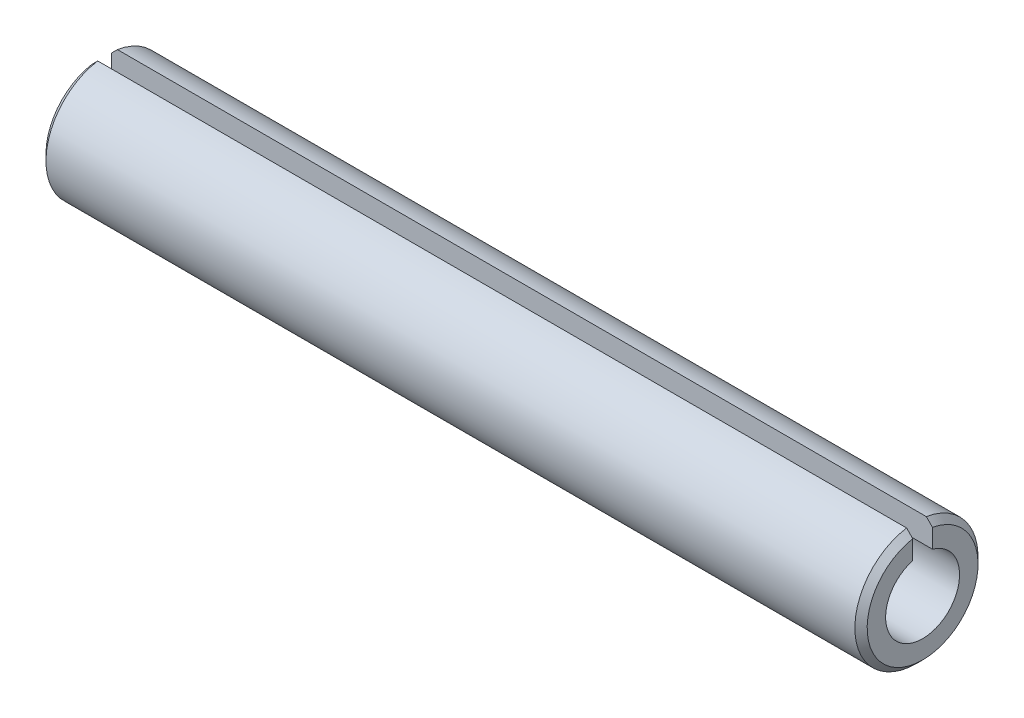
ISO-10303-21;
HEADER;
FILE_DESCRIPTION(('STEP AP214'),'2;1');
FILE_NAME('part.step','',(''),(''),'','','');
FILE_SCHEMA(('AUTOMOTIVE_DESIGN { 1 0 10303 214 1 1 1 1 }'));
ENDSEC;
DATA;
#1=APPLICATION_CONTEXT('core data for automotive mechanical design processes');
#2=APPLICATION_PROTOCOL_DEFINITION('international standard','automotive_design',2000,#1);
#3=PRODUCT_CONTEXT('',#1,'mechanical');
#4=PRODUCT('Part','Part','',(#3));
#5=PRODUCT_RELATED_PRODUCT_CATEGORY('part','',(#4));
#6=PRODUCT_DEFINITION_FORMATION('','',#4);
#7=PRODUCT_DEFINITION_CONTEXT('part definition',#1,'design');
#8=PRODUCT_DEFINITION('design','',#6,#7);
#9=PRODUCT_DEFINITION_SHAPE('','',#8);
#10=(LENGTH_UNIT() NAMED_UNIT(*) SI_UNIT(.MILLI.,.METRE.));
#11=(NAMED_UNIT(*) PLANE_ANGLE_UNIT() SI_UNIT($,.RADIAN.));
#12=(NAMED_UNIT(*) SI_UNIT($,.STERADIAN.) SOLID_ANGLE_UNIT());
#13=UNCERTAINTY_MEASURE_WITH_UNIT(LENGTH_MEASURE(1.E-05),#10,'distance_accuracy_value','');
#14=(GEOMETRIC_REPRESENTATION_CONTEXT(3) GLOBAL_UNCERTAINTY_ASSIGNED_CONTEXT((#13)) GLOBAL_UNIT_ASSIGNED_CONTEXT((#10,
#11,#12)) REPRESENTATION_CONTEXT('',''));
#15=CARTESIAN_POINT('',(0.,0.,0.));
#16=DIRECTION('',(0.,0.,1.));
#17=DIRECTION('',(1.,0.,0.));
#18=AXIS2_PLACEMENT_3D('',#15,#16,#17);
#19=CARTESIAN_POINT('',(0.,0.,0.));
#20=DIRECTION('',(-1.,0.,0.));
#21=DIRECTION('',(0.,0.,1.));
#22=AXIS2_PLACEMENT_3D('',#19,#20,#21);
#23=CYLINDRICAL_SURFACE('',#22,1.8);
#24=DIRECTION('',(-1.,0.,0.));
#25=VECTOR('',#24,1.);
#26=CARTESIAN_POINT('',(40.,1.73481987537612,0.48));
#27=LINE('',#26,#25);
#28=CARTESIAN_POINT('',(40.,1.73481987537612,0.48));
#29=VERTEX_POINT('',#28);
#30=CARTESIAN_POINT('',(0.,1.73481987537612,0.48));
#31=VERTEX_POINT('',#30);
#32=EDGE_CURVE('E47',#29,#31,#27,.T.);
#33=ORIENTED_EDGE('',*,*,#32,.F.);
#34=CARTESIAN_POINT('',(40.,0.,0.));
#35=DIRECTION('',(-1.,0.,0.));
#36=DIRECTION('',(0.,0.,1.));
#37=AXIS2_PLACEMENT_3D('',#34,#35,#36);
#38=CIRCLE('',#37,1.8);
#39=CARTESIAN_POINT('',(40.,1.73481987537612,-0.48));
#40=VERTEX_POINT('',#39);
#41=EDGE_CURVE('E89',#40,#29,#38,.T.);
#42=ORIENTED_EDGE('',*,*,#41,.F.);
#43=DIRECTION('',(-1.,0.,0.));
#44=VECTOR('',#43,1.);
#45=CARTESIAN_POINT('',(40.,1.73481987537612,-0.48));
#46=LINE('',#45,#44);
#47=CARTESIAN_POINT('',(0.,1.73481987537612,-0.48));
#48=VERTEX_POINT('',#47);
#49=EDGE_CURVE('E83',#40,#48,#46,.T.);
#50=ORIENTED_EDGE('',*,*,#49,.T.);
#51=CARTESIAN_POINT('',(0.,0.,0.));
#52=DIRECTION('',(-1.,0.,0.));
#53=DIRECTION('',(0.,0.,1.));
#54=AXIS2_PLACEMENT_3D('',#51,#52,#53);
#55=CIRCLE('',#54,1.8);
#56=EDGE_CURVE('E93',#48,#31,#55,.T.);
#57=ORIENTED_EDGE('',*,*,#56,.T.);
#58=EDGE_LOOP('',(#33,#42,#50,#57));
#59=FACE_BOUND('',#58,.T.);
#60=ADVANCED_FACE('F33',(#59),#23,.F.);
#61=CARTESIAN_POINT('',(40.,1.8,0.));
#62=DIRECTION('',(-1.,0.,0.));
#63=DIRECTION('',(0.,0.,1.));
#64=AXIS2_PLACEMENT_3D('',#61,#62,#63);
#65=PLANE('',#64);
#66=DIRECTION('',(0.,-1.,0.));
#67=VECTOR('',#66,1.);
#68=CARTESIAN_POINT('',(40.,2.96135104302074,0.48));
#69=LINE('',#68,#67);
#70=CARTESIAN_POINT('',(40.,2.65699077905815,0.48));
#71=VERTEX_POINT('',#70);
#72=EDGE_CURVE('E129',#71,#29,#69,.T.);
#73=ORIENTED_EDGE('',*,*,#72,.F.);
#74=CARTESIAN_POINT('',(40.,0.,0.));
#75=DIRECTION('',(-1.,0.,0.));
#76=DIRECTION('',(0.,0.,1.));
#77=AXIS2_PLACEMENT_3D('',#74,#75,#76);
#78=CIRCLE('',#77,2.70000000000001);
#79=CARTESIAN_POINT('',(40.,2.65699077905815,-0.48));
#80=VERTEX_POINT('',#79);
#81=EDGE_CURVE('E121',#80,#71,#78,.T.);
#82=ORIENTED_EDGE('',*,*,#81,.F.);
#83=DIRECTION('',(0.,-1.,0.));
#84=VECTOR('',#83,1.);
#85=CARTESIAN_POINT('',(40.,2.96135104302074,-0.48));
#86=LINE('',#85,#84);
#87=EDGE_CURVE('E130',#80,#40,#86,.T.);
#88=ORIENTED_EDGE('',*,*,#87,.T.);
#89=ORIENTED_EDGE('',*,*,#41,.T.);
#90=EDGE_LOOP('',(#73,#82,#88,#89));
#91=FACE_BOUND('',#90,.T.);
#92=ADVANCED_FACE('F127',(#91),#65,.F.);
#93=CARTESIAN_POINT('',(40.,0.,0.));
#94=DIRECTION('',(-1.,0.,0.));
#95=DIRECTION('',(0.,0.,1.));
#96=AXIS2_PLACEMENT_3D('',#93,#94,#95);
#97=CONICAL_SURFACE('',#96,2.70000000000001,0.785398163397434);
#98=CARTESIAN_POINT('',(38.172376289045,4.5021080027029,0.48));
#99=CARTESIAN_POINT('',(38.3124694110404,4.36121634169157,0.48));
#100=CARTESIAN_POINT('',(38.4525296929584,4.22029197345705,0.48));
#101=CARTESIAN_POINT('',(38.7325483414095,3.93834411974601,0.48));
#102=CARTESIAN_POINT('',(38.8725067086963,3.797320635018,0.48));
#103=CARTESIAN_POINT('',(39.1522810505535,3.51514513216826,0.48));
#104=CARTESIAN_POINT('',(39.2920970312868,3.37399312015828,0.48));
#105=CARTESIAN_POINT('',(39.5715338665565,3.09149379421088,0.48));
#106=CARTESIAN_POINT('',(39.7111547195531,2.95014647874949,0.48));
#107=CARTESIAN_POINT('',(39.9901090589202,2.66714775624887,0.48));
#108=CARTESIAN_POINT('',(40.1294425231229,2.52549632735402,0.48));
#109=CARTESIAN_POINT('',(40.4076320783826,2.24172964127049,0.48));
#110=CARTESIAN_POINT('',(40.5464881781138,2.09961439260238,0.48));
#111=CARTESIAN_POINT('',(40.7541331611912,1.88580999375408,0.48));
#112=CARTESIAN_POINT('',(40.823244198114,1.81443392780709,0.48));
#113=CARTESIAN_POINT('',(40.9611585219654,1.67138644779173,0.48));
#114=CARTESIAN_POINT('',(41.0299618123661,1.59971503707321,0.48));
#115=CARTESIAN_POINT('',(41.1671274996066,1.45594150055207,0.48));
#116=CARTESIAN_POINT('',(41.2354898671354,1.38383934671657,0.48));
#117=CARTESIAN_POINT('',(41.3375138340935,1.27519517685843,0.48));
#118=CARTESIAN_POINT('',(41.3714358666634,1.23889793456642,0.48));
#119=CARTESIAN_POINT('',(41.4390521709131,1.16609108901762,0.48));
#120=CARTESIAN_POINT('',(41.4727464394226,1.12958148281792,0.48));
#121=CARTESIAN_POINT('',(41.5062992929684,1.09294161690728,0.48));
#122=B_SPLINE_CURVE_WITH_KNOTS('',3,(#98,#99,#100,#101,#102,#103,#104,#105,#106,#107,#108,#109,
#110,#111,#112,#113,#114,#115,#116,#117,#118,#119,#120,#121),.UNSPECIFIED.,.F.,.F.,(4,2,2,2,2,2,
2,2,2,2,2,4),(0.,0.596061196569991,1.19211793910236,1.78814768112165,2.38418210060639,
2.98026089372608,3.57632879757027,3.87438502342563,4.17243787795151,4.470510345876,
4.61955225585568,4.76859623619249),.UNSPECIFIED.);
#123=CARTESIAN_POINT('',(39.7,2.96135104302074,0.48));
#124=VERTEX_POINT('',#123);
#125=EDGE_CURVE('E101',#124,#71,#122,.T.);
#126=ORIENTED_EDGE('',*,*,#125,.F.);
#127=CARTESIAN_POINT('',(39.7,0.,0.));
#128=DIRECTION('',(-1.,0.,0.));
#129=DIRECTION('',(0.,0.,1.));
#130=AXIS2_PLACEMENT_3D('',#127,#128,#129);
#131=CIRCLE('',#130,3.);
#132=CARTESIAN_POINT('',(39.7,2.96135104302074,-0.48));
#133=VERTEX_POINT('',#132);
#134=EDGE_CURVE('E118',#133,#124,#131,.T.);
#135=ORIENTED_EDGE('',*,*,#134,.F.);
#136=CARTESIAN_POINT('',(38.172376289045,4.5021080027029,-0.48));
#137=CARTESIAN_POINT('',(38.3124694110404,4.36121634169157,-0.48));
#138=CARTESIAN_POINT('',(38.4525296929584,4.22029197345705,-0.48));
#139=CARTESIAN_POINT('',(38.7325483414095,3.93834411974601,-0.48));
#140=CARTESIAN_POINT('',(38.8725067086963,3.797320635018,-0.48));
#141=CARTESIAN_POINT('',(39.1522810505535,3.51514513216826,-0.48));
#142=CARTESIAN_POINT('',(39.2920970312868,3.37399312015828,-0.48));
#143=CARTESIAN_POINT('',(39.5715338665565,3.09149379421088,-0.48));
#144=CARTESIAN_POINT('',(39.7111547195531,2.95014647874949,-0.48));
#145=CARTESIAN_POINT('',(39.9901090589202,2.66714775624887,-0.48));
#146=CARTESIAN_POINT('',(40.1294425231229,2.52549632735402,-0.48));
#147=CARTESIAN_POINT('',(40.4076320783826,2.24172964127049,-0.48));
#148=CARTESIAN_POINT('',(40.5464881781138,2.09961439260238,-0.48));
#149=CARTESIAN_POINT('',(40.7541331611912,1.88580999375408,-0.48));
#150=CARTESIAN_POINT('',(40.823244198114,1.81443392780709,-0.48));
#151=CARTESIAN_POINT('',(40.9611585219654,1.67138644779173,-0.48));
#152=CARTESIAN_POINT('',(41.0299618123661,1.59971503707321,-0.48));
#153=CARTESIAN_POINT('',(41.1671274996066,1.45594150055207,-0.48));
#154=CARTESIAN_POINT('',(41.2354898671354,1.38383934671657,-0.48));
#155=CARTESIAN_POINT('',(41.3375138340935,1.27519517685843,-0.48));
#156=CARTESIAN_POINT('',(41.3714358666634,1.23889793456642,-0.48));
#157=CARTESIAN_POINT('',(41.4390521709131,1.16609108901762,-0.48));
#158=CARTESIAN_POINT('',(41.4727464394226,1.12958148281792,-0.48));
#159=CARTESIAN_POINT('',(41.5062992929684,1.09294161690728,-0.48));
#160=B_SPLINE_CURVE_WITH_KNOTS('',3,(#136,#137,#138,#139,#140,#141,#142,#143,#144,#145,#146,
#147,#148,#149,#150,#151,#152,#153,#154,#155,#156,#157,#158,#159),.UNSPECIFIED.,.F.,.F.,(4,2,2,
2,2,2,2,2,2,2,2,4),(0.,0.596061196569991,1.19211793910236,1.78814768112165,2.38418210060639,
2.98026089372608,3.57632879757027,3.87438502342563,4.17243787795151,4.470510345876,
4.61955225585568,4.76859623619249),.UNSPECIFIED.);
#161=EDGE_CURVE('E146',#133,#80,#160,.T.);
#162=ORIENTED_EDGE('',*,*,#161,.T.);
#163=ORIENTED_EDGE('',*,*,#81,.T.);
#164=EDGE_LOOP('',(#126,#135,#162,#163));
#165=FACE_BOUND('',#164,.T.);
#166=ADVANCED_FACE('F168',(#165),#97,.T.);
#167=CARTESIAN_POINT('',(0.,0.,0.));
#168=DIRECTION('',(-1.,0.,0.));
#169=DIRECTION('',(0.,0.,1.));
#170=AXIS2_PLACEMENT_3D('',#167,#168,#169);
#171=CYLINDRICAL_SURFACE('',#170,3.);
#172=DIRECTION('',(-1.,0.,0.));
#173=VECTOR('',#172,1.);
#174=CARTESIAN_POINT('',(40.,2.96135104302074,0.48));
#175=LINE('',#174,#173);
#176=CARTESIAN_POINT('',(0.3,2.96135104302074,0.48));
#177=VERTEX_POINT('',#176);
#178=EDGE_CURVE('E137',#124,#177,#175,.T.);
#179=ORIENTED_EDGE('',*,*,#178,.T.);
#180=CARTESIAN_POINT('',(0.299999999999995,0.,0.));
#181=DIRECTION('',(-1.,0.,0.));
#182=DIRECTION('',(0.,0.,1.));
#183=AXIS2_PLACEMENT_3D('',#180,#181,#182);
#184=CIRCLE('',#183,3.);
#185=CARTESIAN_POINT('',(0.3,2.96135104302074,-0.48));
#186=VERTEX_POINT('',#185);
#187=EDGE_CURVE('E105',#186,#177,#184,.T.);
#188=ORIENTED_EDGE('',*,*,#187,.F.);
#189=DIRECTION('',(-1.,0.,0.));
#190=VECTOR('',#189,1.);
#191=CARTESIAN_POINT('',(40.,2.96135104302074,-0.48));
#192=LINE('',#191,#190);
#193=EDGE_CURVE('E96',#133,#186,#192,.T.);
#194=ORIENTED_EDGE('',*,*,#193,.F.);
#195=ORIENTED_EDGE('',*,*,#134,.T.);
#196=EDGE_LOOP('',(#179,#188,#194,#195));
#197=FACE_BOUND('',#196,.T.);
#198=ADVANCED_FACE('F172',(#197),#171,.T.);
#199=CARTESIAN_POINT('',(0.299999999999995,0.,0.));
#200=DIRECTION('',(1.,0.,0.));
#201=DIRECTION('',(0.,0.,-1.));
#202=AXIS2_PLACEMENT_3D('',#199,#200,#201);
#203=CONICAL_SURFACE('',#202,3.,0.785398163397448);
#204=CARTESIAN_POINT('',(-1.50629929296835,1.09294161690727,0.48));
#205=CARTESIAN_POINT('',(-1.46693034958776,1.13592876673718,0.48));
#206=CARTESIAN_POINT('',(-1.4273696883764,1.17873905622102,0.48));
#207=CARTESIAN_POINT('',(-1.34794781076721,1.26407862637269,0.48));
#208=CARTESIAN_POINT('',(-1.30808659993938,1.30660791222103,0.48));
#209=CARTESIAN_POINT('',(-1.18817777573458,1.4338819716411,0.48));
#210=CARTESIAN_POINT('',(-1.10780149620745,1.51831671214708,0.48));
#211=CARTESIAN_POINT('',(-0.946523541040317,1.6866701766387,0.48));
#212=CARTESIAN_POINT('',(-0.865621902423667,1.77058893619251,0.48));
#213=CARTESIAN_POINT('',(-0.703466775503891,1.93808758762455,0.48));
#214=CARTESIAN_POINT('',(-0.622213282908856,2.02166747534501,0.48));
#215=CARTESIAN_POINT('',(-0.42617230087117,2.22274153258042,0.48));
#216=CARTESIAN_POINT('',(-0.311266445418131,2.34012021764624,0.48));
#217=CARTESIAN_POINT('',(-0.0811489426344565,2.57458258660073,0.48));
#218=CARTESIAN_POINT('',(0.0340627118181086,2.69166626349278,0.48));
#219=CARTESIAN_POINT('',(0.428327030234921,3.09165947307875,0.48));
#220=CARTESIAN_POINT('',(0.707859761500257,3.37409563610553,0.48));
#221=CARTESIAN_POINT('',(1.12753512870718,3.79735781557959,0.48));
#222=CARTESIAN_POINT('',(1.26748509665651,3.93837530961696,0.48));
#223=CARTESIAN_POINT('',(1.54748573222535,4.22030998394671,0.48));
#224=CARTESIAN_POINT('',(1.68753639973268,4.36122716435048,0.48));
#225=CARTESIAN_POINT('',(1.82762371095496,4.50210800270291,0.48));
#226=B_SPLINE_CURVE_WITH_KNOTS('',3,(#204,#205,#206,#207,#208,#209,#210,#211,#212,#213,#214,
#215,#216,#217,#218,#219,#220,#221,#222,#223,#224,#225),.UNSPECIFIED.,.F.,.F.,(4,2,2,2,2,2,2,2,
2,2,4),(0.,0.17487022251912,0.349737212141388,0.699455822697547,1.0491500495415,
1.39884855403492,1.89162547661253,2.38441397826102,3.57654376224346,4.17257009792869,
4.76859577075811),.UNSPECIFIED.);
#227=CARTESIAN_POINT('',(0.,2.65699077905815,0.48));
#228=VERTEX_POINT('',#227);
#229=EDGE_CURVE('E107',#228,#177,#226,.T.);
#230=ORIENTED_EDGE('',*,*,#229,.F.);
#231=CARTESIAN_POINT('',(0.,0.,0.));
#232=DIRECTION('',(-1.,0.,0.));
#233=DIRECTION('',(0.,0.,1.));
#234=AXIS2_PLACEMENT_3D('',#231,#232,#233);
#235=CIRCLE('',#234,2.70000000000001);
#236=CARTESIAN_POINT('',(0.,2.65699077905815,-0.48));
#237=VERTEX_POINT('',#236);
#238=EDGE_CURVE('E100',#237,#228,#235,.T.);
#239=ORIENTED_EDGE('',*,*,#238,.F.);
#240=CARTESIAN_POINT('',(-1.50629929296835,1.09294161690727,-0.48));
#241=CARTESIAN_POINT('',(-1.46693034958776,1.13592876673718,-0.48));
#242=CARTESIAN_POINT('',(-1.4273696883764,1.17873905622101,-0.48));
#243=CARTESIAN_POINT('',(-1.34794781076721,1.26407862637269,-0.48));
#244=CARTESIAN_POINT('',(-1.30808659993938,1.30660791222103,-0.48));
#245=CARTESIAN_POINT('',(-1.18817777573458,1.4338819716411,-0.48));
#246=CARTESIAN_POINT('',(-1.10780149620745,1.51831671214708,-0.48));
#247=CARTESIAN_POINT('',(-0.946523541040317,1.6866701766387,-0.48));
#248=CARTESIAN_POINT('',(-0.865621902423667,1.77058893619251,-0.48));
#249=CARTESIAN_POINT('',(-0.703466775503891,1.93808758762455,-0.48));
#250=CARTESIAN_POINT('',(-0.622213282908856,2.02166747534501,-0.48));
#251=CARTESIAN_POINT('',(-0.42617230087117,2.22274153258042,-0.48));
#252=CARTESIAN_POINT('',(-0.311266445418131,2.34012021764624,-0.48));
#253=CARTESIAN_POINT('',(-0.0811489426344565,2.57458258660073,-0.48));
#254=CARTESIAN_POINT('',(0.0340627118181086,2.69166626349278,-0.48));
#255=CARTESIAN_POINT('',(0.428327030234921,3.09165947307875,-0.48));
#256=CARTESIAN_POINT('',(0.707859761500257,3.37409563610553,-0.48));
#257=CARTESIAN_POINT('',(1.12753512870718,3.79735781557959,-0.48));
#258=CARTESIAN_POINT('',(1.26748509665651,3.93837530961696,-0.48));
#259=CARTESIAN_POINT('',(1.54748573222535,4.22030998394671,-0.48));
#260=CARTESIAN_POINT('',(1.68753639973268,4.36122716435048,-0.48));
#261=CARTESIAN_POINT('',(1.82762371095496,4.50210800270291,-0.48));
#262=B_SPLINE_CURVE_WITH_KNOTS('',3,(#240,#241,#242,#243,#244,#245,#246,#247,#248,#249,#250,
#251,#252,#253,#254,#255,#256,#257,#258,#259,#260,#261),.UNSPECIFIED.,.F.,.F.,(4,2,2,2,2,2,2,2,
2,2,4),(0.,0.17487022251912,0.349737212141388,0.699455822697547,1.0491500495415,
1.39884855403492,1.89162547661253,2.38441397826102,3.57654376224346,4.17257009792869,
4.76859577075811),.UNSPECIFIED.);
#263=EDGE_CURVE('E54',#237,#186,#262,.T.);
#264=ORIENTED_EDGE('',*,*,#263,.T.);
#265=ORIENTED_EDGE('',*,*,#187,.T.);
#266=EDGE_LOOP('',(#230,#239,#264,#265));
#267=FACE_BOUND('',#266,.T.);
#268=ADVANCED_FACE('F150',(#267),#203,.T.);
#269=CARTESIAN_POINT('',(0.,1.8,0.));
#270=DIRECTION('',(-1.,0.,0.));
#271=DIRECTION('',(0.,0.,1.));
#272=AXIS2_PLACEMENT_3D('',#269,#270,#271);
#273=PLANE('',#272);
#274=ORIENTED_EDGE('',*,*,#238,.T.);
#275=DIRECTION('',(0.,-1.,0.));
#276=VECTOR('',#275,1.);
#277=CARTESIAN_POINT('',(0.,1.8,0.48));
#278=LINE('',#277,#276);
#279=EDGE_CURVE('E11',#228,#31,#278,.T.);
#280=ORIENTED_EDGE('',*,*,#279,.T.);
#281=ORIENTED_EDGE('',*,*,#56,.F.);
#282=DIRECTION('',(0.,-1.,0.));
#283=VECTOR('',#282,1.);
#284=CARTESIAN_POINT('',(0.,1.8,-0.48));
#285=LINE('',#284,#283);
#286=EDGE_CURVE('E40',#237,#48,#285,.T.);
#287=ORIENTED_EDGE('',*,*,#286,.F.);
#288=EDGE_LOOP('',(#274,#280,#281,#287));
#289=FACE_BOUND('',#288,.T.);
#290=ADVANCED_FACE('F98',(#289),#273,.T.);
#291=CARTESIAN_POINT('',(40.,2.96135104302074,-0.48));
#292=DIRECTION('',(0.,0.,-1.));
#293=DIRECTION('',(0.,1.,0.));
#294=AXIS2_PLACEMENT_3D('',#291,#292,#293);
#295=PLANE('',#294);
#296=ORIENTED_EDGE('',*,*,#193,.T.);
#297=ORIENTED_EDGE('',*,*,#263,.F.);
#298=ORIENTED_EDGE('',*,*,#286,.T.);
#299=ORIENTED_EDGE('',*,*,#49,.F.);
#300=ORIENTED_EDGE('',*,*,#87,.F.);
#301=ORIENTED_EDGE('',*,*,#161,.F.);
#302=EDGE_LOOP('',(#296,#297,#298,#299,#300,#301));
#303=FACE_BOUND('',#302,.T.);
#304=ADVANCED_FACE('F82',(#303),#295,.F.);
#305=CARTESIAN_POINT('',(40.,2.96135104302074,0.48));
#306=DIRECTION('',(0.,0.,-1.));
#307=DIRECTION('',(0.,1.,0.));
#308=AXIS2_PLACEMENT_3D('',#305,#306,#307);
#309=PLANE('',#308);
#310=ORIENTED_EDGE('',*,*,#125,.T.);
#311=ORIENTED_EDGE('',*,*,#72,.T.);
#312=ORIENTED_EDGE('',*,*,#32,.T.);
#313=ORIENTED_EDGE('',*,*,#279,.F.);
#314=ORIENTED_EDGE('',*,*,#229,.T.);
#315=ORIENTED_EDGE('',*,*,#178,.F.);
#316=EDGE_LOOP('',(#310,#311,#312,#313,#314,#315));
#317=FACE_BOUND('',#316,.T.);
#318=ADVANCED_FACE('F156',(#317),#309,.T.);
#319=CLOSED_SHELL('',(#60,#92,#166,#198,#268,#290,#304,#318));
#320=MANIFOLD_SOLID_BREP('B2',#319);
#321=ADVANCED_BREP_SHAPE_REPRESENTATION('',(#18,#320),#14);
#322=SHAPE_DEFINITION_REPRESENTATION(#9,#321);
ENDSEC;
END-ISO-10303-21;
